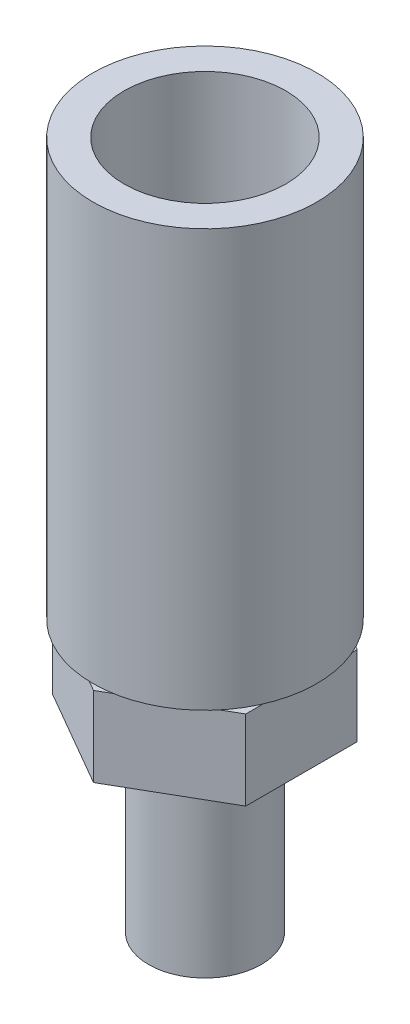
from build123d import *

# Parameters (mm, degrees)
EXTRUDE1_DEPTH    = 7.874
SKETCH3_R         = 7.875
EXTRUDE2_DEPTH    = 10.41
SKETCH4_R         = 0.955
EXTRUDE8_DEPTH    = 10.41
CIRPATTERN1_COUNT = 6
SKETCH_1_R        = 0.955
EXTRUDE9_DEPTH    = 10.41
SKETCH8_R         = 5.55625
EXTRUDE7_DEPTH    = 18.28030303
SKETCH9_R         = 0.89


with BuildPart() as part:
    # Sketch1 → Extrude1 (new body)
    with BuildSketch(Plane(origin=(0, 0, 0), x_dir=(1, 0, 0), z_dir=(0, 1, 0))):
        Polygon((0, 10.998522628), (-9.525, 5.499261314), (-9.525, -5.499261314), (0, -10.998522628), (9.525, -5.499261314), (9.525, 5.499261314), align=None)
    extrude(amount=EXTRUDE1_DEPTH)

    # Sketch2 → Revolve1 (revolve)
    with BuildSketch(Plane.XY, mode=Mode.PRIVATE) as revolve1_sk:
        Polygon((8.8011, 7.874), (8.8011, 11.6586), (9.398, 11.6586), (9.398, 13.2334), (8.8011, 13.2334), (8.8011, 14.8844), (9.398, 14.8844), (9.398, 16.4592), (8.8011, 16.4592), (8.8011, 17.272), (0, 17.272), (0, 7.874), align=None)
    revolve(revolve1_sk.sketch.rotate(Axis((0, 0, 0), (0, -1, 0)), 180), axis=Axis((0, 0, 0), (0, -1, 0)))

    # Sketch3 → Extrude2 (add)
    with BuildSketch(Plane(origin=(0, 17.272, 0), x_dir=(-1, 0, 0), z_dir=(0, 1, 0))):
        with Locations(Location((0, 0, 0), (0, 0, 180))):
            Circle(SKETCH3_R)
    extrude(amount=EXTRUDE2_DEPTH)

    # Sketch4 → Extrude8 (cut)
    with BuildSketch(Plane(origin=(0, 27.682, 0), x_dir=(-1, 0, 0), z_dir=(0, 1, 0))):
        with Locations((0, -5.08)):
            Circle(SKETCH4_R)
    extrude8 = extrude(amount=-EXTRUDE8_DEPTH, mode=Mode.SUBTRACT)

    # CirPattern1: Extrude8 ×6 about axis, 1 skipped
    cirpattern1_axis = Axis((0, 0, 0), (0, -1, 0))
    add([extrude8.rotate(cirpattern1_axis, i * 360 / CIRPATTERN1_COUNT) for i in range(1, CIRPATTERN1_COUNT) if i not in (3,)], mode=Mode.SUBTRACT)

    # Sketch 1 → Extrude9 (cut)
    with BuildSketch(Plane(origin=(0.09953018, 27.682, 4.480198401), x_dir=(-1, 0, 0), z_dir=(0, 1, 0))):
        with Locations((0.09953018, -4.480198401)):
            Circle(SKETCH_1_R)
    extrude(amount=-EXTRUDE9_DEPTH, mode=Mode.SUBTRACT)

    # Sketch8 → Extrude7 (add)
    with BuildSketch(Plane.XZ):
        with Locations(Location((0, 0, 0), (0, 0, 90))):
            Circle(SKETCH8_R)
    extrude(amount=EXTRUDE7_DEPTH)

    # Sketch9 → o-ring 12.42x1.78 (revolve)
    with BuildSketch(Plane.XY, mode=Mode.PRIVATE) as o_ring_12_42x1_78_sk:
        with Locations((7.1, 0.284318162)):
            Circle(SKETCH9_R)
    revolve(o_ring_12_42x1_78_sk.sketch.rotate(Axis((0, 0, 0), (0, -1, 0)), 90), axis=Axis((0, 0, 0), (0, -1, 0)))

    # Sketch10 → Locking Sleeve (revolve)
    with BuildSketch(Plane(origin=(0, 0, 0), x_dir=(0, 0, -1), z_dir=(1, 0, 0))):
        Polygon((-11.049, 8.484655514), (-11.049, 49.632655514), (-7.9756, 49.632655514), (-7.9756, 18.906198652), (-10.56888957, 18.906198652), (-10.56888957, 14.733055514), (-9.0805, 14.733055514), (-9.0805, 13.209055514), (-10.56888957, 13.209055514), (-10.56888957, 11.558055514), (-9.0805, 11.558055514), (-9.0805, 8.484655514), align=None)
    revolve(axis=Axis((0, 0, 0), (0, -1, 0)))


solid = part.part
